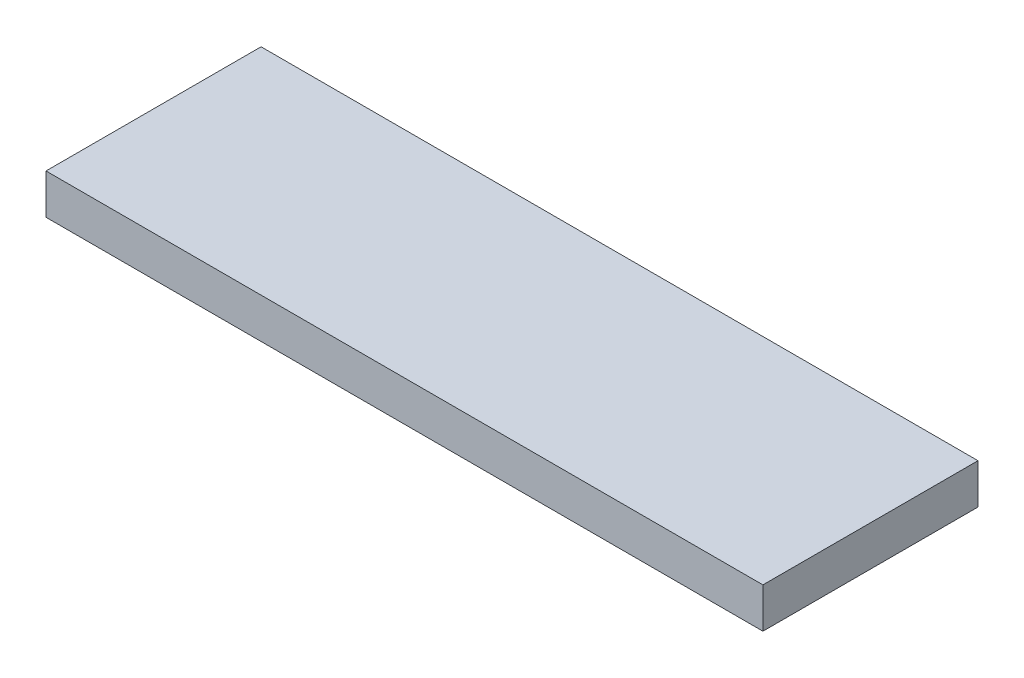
ISO-10303-21;
HEADER;
FILE_DESCRIPTION(('STEP AP214'),'2;1');
FILE_NAME('part.step','',(''),(''),'','','');
FILE_SCHEMA(('AUTOMOTIVE_DESIGN { 1 0 10303 214 1 1 1 1 }'));
ENDSEC;
DATA;
#1=APPLICATION_CONTEXT('core data for automotive mechanical design processes');
#2=APPLICATION_PROTOCOL_DEFINITION('international standard','automotive_design',2000,#1);
#3=PRODUCT_CONTEXT('',#1,'mechanical');
#4=PRODUCT('Part','Part','',(#3));
#5=PRODUCT_RELATED_PRODUCT_CATEGORY('part','',(#4));
#6=PRODUCT_DEFINITION_FORMATION('','',#4);
#7=PRODUCT_DEFINITION_CONTEXT('part definition',#1,'design');
#8=PRODUCT_DEFINITION('design','',#6,#7);
#9=PRODUCT_DEFINITION_SHAPE('','',#8);
#10=(LENGTH_UNIT() NAMED_UNIT(*) SI_UNIT(.MILLI.,.METRE.));
#11=(NAMED_UNIT(*) PLANE_ANGLE_UNIT() SI_UNIT($,.RADIAN.));
#12=(NAMED_UNIT(*) SI_UNIT($,.STERADIAN.) SOLID_ANGLE_UNIT());
#13=UNCERTAINTY_MEASURE_WITH_UNIT(LENGTH_MEASURE(1.E-05),#10,'distance_accuracy_value','');
#14=(GEOMETRIC_REPRESENTATION_CONTEXT(3) GLOBAL_UNCERTAINTY_ASSIGNED_CONTEXT((#13)) GLOBAL_UNIT_ASSIGNED_CONTEXT((#10,
#11,#12)) REPRESENTATION_CONTEXT('',''));
#15=CARTESIAN_POINT('',(0.,0.,0.));
#16=DIRECTION('',(0.,0.,1.));
#17=DIRECTION('',(1.,0.,0.));
#18=AXIS2_PLACEMENT_3D('',#15,#16,#17);
#19=CARTESIAN_POINT('',(0.,2.8,0.));
#20=DIRECTION('',(1.,0.,0.));
#21=DIRECTION('',(0.,0.,-1.));
#22=AXIS2_PLACEMENT_3D('',#19,#20,#21);
#23=PLANE('',#22);
#24=DIRECTION('',(0.,0.,1.));
#25=VECTOR('',#24,1.);
#26=CARTESIAN_POINT('',(0.,0.,0.));
#27=LINE('',#26,#25);
#28=CARTESIAN_POINT('',(0.,0.,-15.));
#29=VERTEX_POINT('',#28);
#30=CARTESIAN_POINT('',(0.,0.,0.));
#31=VERTEX_POINT('',#30);
#32=EDGE_CURVE('E96',#29,#31,#27,.T.);
#33=ORIENTED_EDGE('',*,*,#32,.T.);
#34=DIRECTION('',(0.,-1.,0.));
#35=VECTOR('',#34,1.);
#36=CARTESIAN_POINT('',(0.,2.8,0.));
#37=LINE('',#36,#35);
#38=CARTESIAN_POINT('',(0.,2.8,0.));
#39=VERTEX_POINT('',#38);
#40=EDGE_CURVE('E11',#39,#31,#37,.T.);
#41=ORIENTED_EDGE('',*,*,#40,.F.);
#42=DIRECTION('',(0.,0.,1.));
#43=VECTOR('',#42,1.);
#44=CARTESIAN_POINT('',(0.,2.8,0.));
#45=LINE('',#44,#43);
#46=CARTESIAN_POINT('',(0.,2.8,-15.));
#47=VERTEX_POINT('',#46);
#48=EDGE_CURVE('E84',#47,#39,#45,.T.);
#49=ORIENTED_EDGE('',*,*,#48,.F.);
#50=DIRECTION('',(0.,-1.,0.));
#51=VECTOR('',#50,1.);
#52=CARTESIAN_POINT('',(0.,2.8,-15.));
#53=LINE('',#52,#51);
#54=EDGE_CURVE('E92',#47,#29,#53,.T.);
#55=ORIENTED_EDGE('',*,*,#54,.T.);
#56=EDGE_LOOP('',(#33,#41,#49,#55));
#57=FACE_BOUND('',#56,.T.);
#58=ADVANCED_FACE('F33',(#57),#23,.F.);
#59=CARTESIAN_POINT('',(0.,2.8,0.));
#60=DIRECTION('',(0.,0.,-1.));
#61=DIRECTION('',(-1.,0.,0.));
#62=AXIS2_PLACEMENT_3D('',#59,#60,#61);
#63=PLANE('',#62);
#64=DIRECTION('',(1.,0.,0.));
#65=VECTOR('',#64,1.);
#66=CARTESIAN_POINT('',(0.,0.,0.));
#67=LINE('',#66,#65);
#68=CARTESIAN_POINT('',(50.,0.,0.));
#69=VERTEX_POINT('',#68);
#70=EDGE_CURVE('E88',#31,#69,#67,.T.);
#71=ORIENTED_EDGE('',*,*,#70,.T.);
#72=DIRECTION('',(0.,-1.,0.));
#73=VECTOR('',#72,1.);
#74=CARTESIAN_POINT('',(50.,2.8,0.));
#75=LINE('',#74,#73);
#76=CARTESIAN_POINT('',(50.,2.8,0.));
#77=VERTEX_POINT('',#76);
#78=EDGE_CURVE('E41',#77,#69,#75,.T.);
#79=ORIENTED_EDGE('',*,*,#78,.F.);
#80=DIRECTION('',(1.,0.,0.));
#81=VECTOR('',#80,1.);
#82=CARTESIAN_POINT('',(0.,2.8,0.));
#83=LINE('',#82,#81);
#84=EDGE_CURVE('E79',#39,#77,#83,.T.);
#85=ORIENTED_EDGE('',*,*,#84,.F.);
#86=ORIENTED_EDGE('',*,*,#40,.T.);
#87=EDGE_LOOP('',(#71,#79,#85,#86));
#88=FACE_BOUND('',#87,.T.);
#89=ADVANCED_FACE('F87',(#88),#63,.F.);
#90=CARTESIAN_POINT('',(50.,2.8,0.));
#91=DIRECTION('',(-1.,0.,0.));
#92=DIRECTION('',(0.,0.,1.));
#93=AXIS2_PLACEMENT_3D('',#90,#91,#92);
#94=PLANE('',#93);
#95=DIRECTION('',(0.,0.,-1.));
#96=VECTOR('',#95,1.);
#97=CARTESIAN_POINT('',(50.,0.,0.));
#98=LINE('',#97,#96);
#99=CARTESIAN_POINT('',(50.,0.,-15.));
#100=VERTEX_POINT('',#99);
#101=EDGE_CURVE('E66',#69,#100,#98,.T.);
#102=ORIENTED_EDGE('',*,*,#101,.T.);
#103=DIRECTION('',(0.,-1.,0.));
#104=VECTOR('',#103,1.);
#105=CARTESIAN_POINT('',(50.,2.8,-15.));
#106=LINE('',#105,#104);
#107=CARTESIAN_POINT('',(50.,2.8,-15.));
#108=VERTEX_POINT('',#107);
#109=EDGE_CURVE('E89',#108,#100,#106,.T.);
#110=ORIENTED_EDGE('',*,*,#109,.F.);
#111=DIRECTION('',(0.,0.,-1.));
#112=VECTOR('',#111,1.);
#113=CARTESIAN_POINT('',(50.,2.8,0.));
#114=LINE('',#113,#112);
#115=EDGE_CURVE('E82',#77,#108,#114,.T.);
#116=ORIENTED_EDGE('',*,*,#115,.F.);
#117=ORIENTED_EDGE('',*,*,#78,.T.);
#118=EDGE_LOOP('',(#102,#110,#116,#117));
#119=FACE_BOUND('',#118,.T.);
#120=ADVANCED_FACE('F90',(#119),#94,.F.);
#121=CARTESIAN_POINT('',(0.,2.8,-15.));
#122=DIRECTION('',(0.,0.,1.));
#123=DIRECTION('',(1.,0.,0.));
#124=AXIS2_PLACEMENT_3D('',#121,#122,#123);
#125=PLANE('',#124);
#126=DIRECTION('',(-1.,0.,0.));
#127=VECTOR('',#126,1.);
#128=CARTESIAN_POINT('',(0.,0.,-15.));
#129=LINE('',#128,#127);
#130=EDGE_CURVE('E72',#100,#29,#129,.T.);
#131=ORIENTED_EDGE('',*,*,#130,.T.);
#132=ORIENTED_EDGE('',*,*,#54,.F.);
#133=DIRECTION('',(-1.,0.,0.));
#134=VECTOR('',#133,1.);
#135=CARTESIAN_POINT('',(0.,2.8,-15.));
#136=LINE('',#135,#134);
#137=EDGE_CURVE('E49',#108,#47,#136,.T.);
#138=ORIENTED_EDGE('',*,*,#137,.F.);
#139=ORIENTED_EDGE('',*,*,#109,.T.);
#140=EDGE_LOOP('',(#131,#132,#138,#139));
#141=FACE_BOUND('',#140,.T.);
#142=ADVANCED_FACE('F103',(#141),#125,.F.);
#143=CARTESIAN_POINT('',(0.,2.8,0.));
#144=DIRECTION('',(0.,-1.,0.));
#145=DIRECTION('',(0.,0.,-1.));
#146=AXIS2_PLACEMENT_3D('',#143,#144,#145);
#147=PLANE('',#146);
#148=ORIENTED_EDGE('',*,*,#48,.T.);
#149=ORIENTED_EDGE('',*,*,#84,.T.);
#150=ORIENTED_EDGE('',*,*,#115,.T.);
#151=ORIENTED_EDGE('',*,*,#137,.T.);
#152=EDGE_LOOP('',(#148,#149,#150,#151));
#153=FACE_BOUND('',#152,.T.);
#154=ADVANCED_FACE('F80',(#153),#147,.F.);
#155=CARTESIAN_POINT('',(0.,0.,0.));
#156=DIRECTION('',(0.,-1.,0.));
#157=DIRECTION('',(0.,0.,-1.));
#158=AXIS2_PLACEMENT_3D('',#155,#156,#157);
#159=PLANE('',#158);
#160=ORIENTED_EDGE('',*,*,#32,.F.);
#161=ORIENTED_EDGE('',*,*,#130,.F.);
#162=ORIENTED_EDGE('',*,*,#101,.F.);
#163=ORIENTED_EDGE('',*,*,#70,.F.);
#164=EDGE_LOOP('',(#160,#161,#162,#163));
#165=FACE_BOUND('',#164,.T.);
#166=ADVANCED_FACE('F106',(#165),#159,.T.);
#167=CLOSED_SHELL('',(#58,#89,#120,#142,#154,#166));
#168=MANIFOLD_SOLID_BREP('B2',#167);
#169=ADVANCED_BREP_SHAPE_REPRESENTATION('',(#18,#168),#14);
#170=SHAPE_DEFINITION_REPRESENTATION(#9,#169);
ENDSEC;
END-ISO-10303-21;
